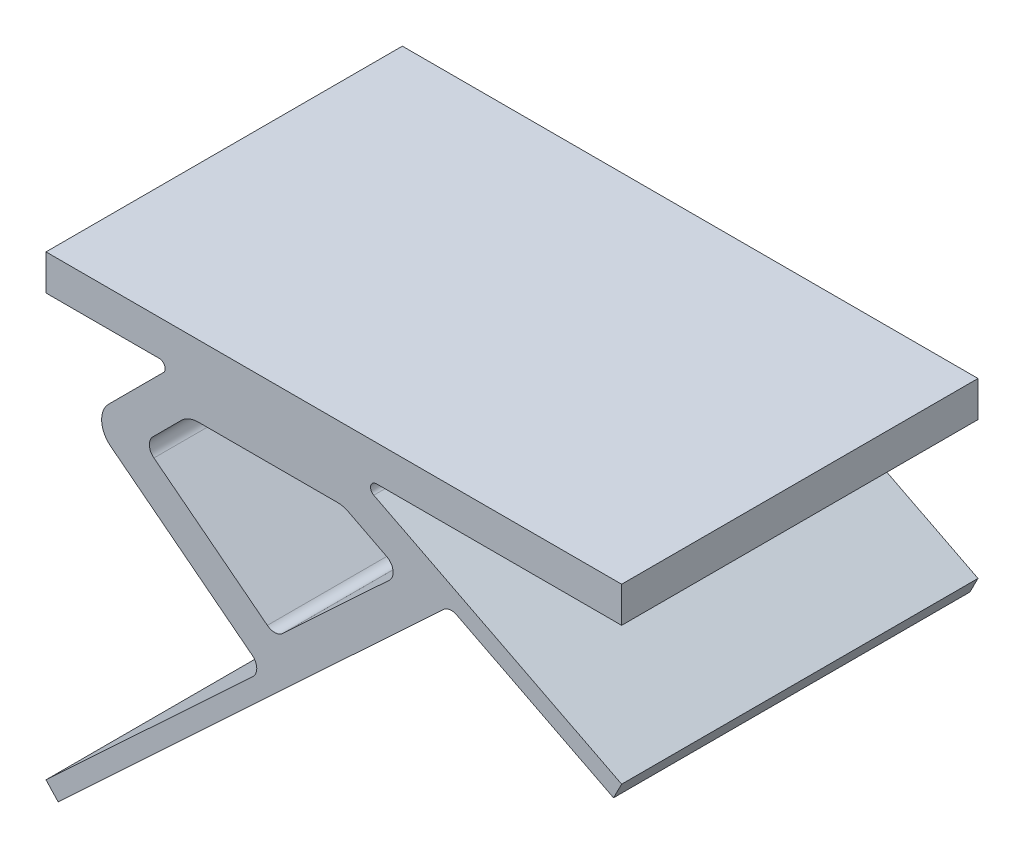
ISO-10303-21;
HEADER;
FILE_DESCRIPTION(('STEP AP214'),'2;1');
FILE_NAME('part.step','',(''),(''),'','','');
FILE_SCHEMA(('AUTOMOTIVE_DESIGN { 1 0 10303 214 1 1 1 1 }'));
ENDSEC;
DATA;
#1=APPLICATION_CONTEXT('core data for automotive mechanical design processes');
#2=APPLICATION_PROTOCOL_DEFINITION('international standard','automotive_design',2000,#1);
#3=PRODUCT_CONTEXT('',#1,'mechanical');
#4=PRODUCT('Part','Part','',(#3));
#5=PRODUCT_RELATED_PRODUCT_CATEGORY('part','',(#4));
#6=PRODUCT_DEFINITION_FORMATION('','',#4);
#7=PRODUCT_DEFINITION_CONTEXT('part definition',#1,'design');
#8=PRODUCT_DEFINITION('design','',#6,#7);
#9=PRODUCT_DEFINITION_SHAPE('','',#8);
#10=(LENGTH_UNIT() NAMED_UNIT(*) SI_UNIT(.MILLI.,.METRE.));
#11=(NAMED_UNIT(*) PLANE_ANGLE_UNIT() SI_UNIT($,.RADIAN.));
#12=(NAMED_UNIT(*) SI_UNIT($,.STERADIAN.) SOLID_ANGLE_UNIT());
#13=UNCERTAINTY_MEASURE_WITH_UNIT(LENGTH_MEASURE(1.E-05),#10,'distance_accuracy_value','');
#14=(GEOMETRIC_REPRESENTATION_CONTEXT(3) GLOBAL_UNCERTAINTY_ASSIGNED_CONTEXT((#13)) GLOBAL_UNIT_ASSIGNED_CONTEXT((#10,
#11,#12)) REPRESENTATION_CONTEXT('',''));
#15=CARTESIAN_POINT('',(0.,0.,0.));
#16=DIRECTION('',(0.,0.,1.));
#17=DIRECTION('',(1.,0.,0.));
#18=AXIS2_PLACEMENT_3D('',#15,#16,#17);
#19=CARTESIAN_POINT('',(-1.20710678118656,-0.5,30.));
#20=DIRECTION('',(0.,0.,1.));
#21=DIRECTION('',(1.,0.,0.));
#22=AXIS2_PLACEMENT_3D('',#19,#20,#21);
#23=CYLINDRICAL_SURFACE('',#22,0.5);
#24=DIRECTION('',(0.,0.,-1.));
#25=VECTOR('',#24,1.);
#26=CARTESIAN_POINT('',(-0.853553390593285,-0.853553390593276,30.));
#27=LINE('',#26,#25);
#28=CARTESIAN_POINT('',(-0.853553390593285,-0.853553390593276,30.));
#29=VERTEX_POINT('',#28);
#30=CARTESIAN_POINT('',(-0.853553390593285,-0.853553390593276,0.));
#31=VERTEX_POINT('',#30);
#32=EDGE_CURVE('E478',#29,#31,#27,.T.);
#33=ORIENTED_EDGE('',*,*,#32,.F.);
#34=CARTESIAN_POINT('',(-1.20710678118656,-0.5,30.));
#35=DIRECTION('',(0.,0.,-1.));
#36=DIRECTION('',(-1.,0.,0.));
#37=AXIS2_PLACEMENT_3D('',#34,#35,#36);
#38=CIRCLE('',#37,0.5);
#39=CARTESIAN_POINT('',(-1.20710678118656,0.,30.));
#40=VERTEX_POINT('',#39);
#41=EDGE_CURVE('E46',#29,#40,#38,.F.);
#42=ORIENTED_EDGE('',*,*,#41,.T.);
#43=DIRECTION('',(0.,0.,-1.));
#44=VECTOR('',#43,1.);
#45=CARTESIAN_POINT('',(-1.20710678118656,0.,30.));
#46=LINE('',#45,#44);
#47=CARTESIAN_POINT('',(-1.20710678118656,0.,0.));
#48=VERTEX_POINT('',#47);
#49=EDGE_CURVE('E482',#48,#40,#46,.F.);
#50=ORIENTED_EDGE('',*,*,#49,.F.);
#51=CARTESIAN_POINT('',(-1.20710678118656,-0.5,0.));
#52=DIRECTION('',(0.,0.,-1.));
#53=DIRECTION('',(-1.,0.,0.));
#54=AXIS2_PLACEMENT_3D('',#51,#52,#53);
#55=CIRCLE('',#54,0.5);
#56=EDGE_CURVE('E11',#48,#31,#55,.T.);
#57=ORIENTED_EDGE('',*,*,#56,.T.);
#58=EDGE_LOOP('',(#33,#42,#50,#57));
#59=FACE_BOUND('',#58,.T.);
#60=ADVANCED_FACE('F38',(#59),#23,.F.);
#61=CARTESIAN_POINT('',(17.0826498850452,-0.5,30.));
#62=DIRECTION('',(0.,0.,-1.));
#63=DIRECTION('',(-1.,0.,0.));
#64=AXIS2_PLACEMENT_3D('',#61,#62,#63);
#65=CYLINDRICAL_SURFACE('',#64,0.5);
#66=DIRECTION('',(0.,0.,1.));
#67=VECTOR('',#66,1.);
#68=CARTESIAN_POINT('',(16.8556546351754,-0.945503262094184,30.));
#69=LINE('',#68,#67);
#70=CARTESIAN_POINT('',(16.8556546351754,-0.945503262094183,0.));
#71=VERTEX_POINT('',#70);
#72=CARTESIAN_POINT('',(16.8556546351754,-0.945503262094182,30.));
#73=VERTEX_POINT('',#72);
#74=EDGE_CURVE('E464',#71,#73,#69,.T.);
#75=ORIENTED_EDGE('',*,*,#74,.F.);
#76=CARTESIAN_POINT('',(17.0826498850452,-0.5,0.));
#77=DIRECTION('',(0.,0.,-1.));
#78=DIRECTION('',(-1.,0.,0.));
#79=AXIS2_PLACEMENT_3D('',#76,#77,#78);
#80=CIRCLE('',#79,0.5);
#81=CARTESIAN_POINT('',(17.0826498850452,0.,0.));
#82=VERTEX_POINT('',#81);
#83=EDGE_CURVE('E472',#71,#82,#80,.T.);
#84=ORIENTED_EDGE('',*,*,#83,.T.);
#85=DIRECTION('',(0.,0.,1.));
#86=VECTOR('',#85,1.);
#87=CARTESIAN_POINT('',(17.0826498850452,0.,30.));
#88=LINE('',#87,#86);
#89=CARTESIAN_POINT('',(17.0826498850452,0.,30.));
#90=VERTEX_POINT('',#89);
#91=EDGE_CURVE('E468',#90,#82,#88,.F.);
#92=ORIENTED_EDGE('',*,*,#91,.F.);
#93=CARTESIAN_POINT('',(17.0826498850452,-0.5,30.));
#94=DIRECTION('',(0.,0.,-1.));
#95=DIRECTION('',(-1.,0.,0.));
#96=AXIS2_PLACEMENT_3D('',#93,#94,#95);
#97=CIRCLE('',#96,0.5);
#98=EDGE_CURVE('E475',#90,#73,#97,.F.);
#99=ORIENTED_EDGE('',*,*,#98,.T.);
#100=EDGE_LOOP('',(#75,#84,#92,#99));
#101=FACE_BOUND('',#100,.T.);
#102=ADVANCED_FACE('F532',(#101),#65,.F.);
#103=CARTESIAN_POINT('',(6.00535955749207,-18.5090162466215,30.));
#104=DIRECTION('',(0.,0.,-1.));
#105=DIRECTION('',(-1.,0.,0.));
#106=AXIS2_PLACEMENT_3D('',#103,#104,#105);
#107=CYLINDRICAL_SURFACE('',#106,1.);
#108=DIRECTION('',(0.,0.,1.));
#109=VECTOR('',#108,1.);
#110=CARTESIAN_POINT('',(6.61931929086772,-17.7196789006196,30.));
#111=LINE('',#110,#109);
#112=CARTESIAN_POINT('',(6.61931929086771,-17.7196789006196,0.));
#113=VERTEX_POINT('',#112);
#114=CARTESIAN_POINT('',(6.61931929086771,-17.7196789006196,30.));
#115=VERTEX_POINT('',#114);
#116=EDGE_CURVE('E452',#113,#115,#111,.T.);
#117=ORIENTED_EDGE('',*,*,#116,.F.);
#118=CARTESIAN_POINT('',(6.00535955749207,-18.5090162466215,0.));
#119=DIRECTION('',(0.,0.,-1.));
#120=DIRECTION('',(-1.,0.,0.));
#121=AXIS2_PLACEMENT_3D('',#118,#119,#120);
#122=CIRCLE('',#121,1.);
#123=CARTESIAN_POINT('',(6.68735791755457,-19.2403699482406,0.));
#124=VERTEX_POINT('',#123);
#125=EDGE_CURVE('E459',#113,#124,#122,.T.);
#126=ORIENTED_EDGE('',*,*,#125,.T.);
#127=DIRECTION('',(0.,0.,1.));
#128=VECTOR('',#127,1.);
#129=CARTESIAN_POINT('',(6.68735791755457,-19.2403699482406,30.));
#130=LINE('',#129,#128);
#131=CARTESIAN_POINT('',(6.68735791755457,-19.2403699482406,30.));
#132=VERTEX_POINT('',#131);
#133=EDGE_CURVE('E456',#132,#124,#130,.F.);
#134=ORIENTED_EDGE('',*,*,#133,.F.);
#135=CARTESIAN_POINT('',(6.00535955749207,-18.5090162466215,30.));
#136=DIRECTION('',(0.,0.,-1.));
#137=DIRECTION('',(-1.,0.,0.));
#138=AXIS2_PLACEMENT_3D('',#135,#136,#137);
#139=CIRCLE('',#138,1.);
#140=EDGE_CURVE('E229',#132,#115,#139,.F.);
#141=ORIENTED_EDGE('',*,*,#140,.T.);
#142=EDGE_LOOP('',(#117,#126,#134,#141));
#143=FACE_BOUND('',#142,.T.);
#144=ADVANCED_FACE('F508',(#143),#107,.F.);
#145=CARTESIAN_POINT('',(23.3917258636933,-7.08161348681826,30.));
#146=DIRECTION('',(0.,0.,1.));
#147=DIRECTION('',(1.,0.,0.));
#148=AXIS2_PLACEMENT_3D('',#145,#146,#147);
#149=CYLINDRICAL_SURFACE('',#148,1.);
#150=DIRECTION('',(0.,0.,-1.));
#151=VECTOR('',#150,1.);
#152=CARTESIAN_POINT('',(23.8457163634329,-6.1906069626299,30.));
#153=LINE('',#152,#151);
#154=CARTESIAN_POINT('',(23.8457163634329,-6.19060696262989,30.));
#155=VERTEX_POINT('',#154);
#156=CARTESIAN_POINT('',(23.8457163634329,-6.19060696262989,0.));
#157=VERTEX_POINT('',#156);
#158=EDGE_CURVE('E438',#155,#157,#153,.T.);
#159=ORIENTED_EDGE('',*,*,#158,.F.);
#160=CARTESIAN_POINT('',(23.3917258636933,-7.08161348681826,30.));
#161=DIRECTION('',(0.,0.,-1.));
#162=DIRECTION('',(-1.,0.,0.));
#163=AXIS2_PLACEMENT_3D('',#160,#161,#162);
#164=CIRCLE('',#163,1.);
#165=CARTESIAN_POINT('',(22.7097275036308,-6.35025978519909,30.));
#166=VERTEX_POINT('',#165);
#167=EDGE_CURVE('E446',#155,#166,#164,.F.);
#168=ORIENTED_EDGE('',*,*,#167,.T.);
#169=DIRECTION('',(0.,0.,-1.));
#170=VECTOR('',#169,1.);
#171=CARTESIAN_POINT('',(22.7097275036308,-6.35025978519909,30.));
#172=LINE('',#171,#170);
#173=CARTESIAN_POINT('',(22.7097275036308,-6.3502597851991,0.));
#174=VERTEX_POINT('',#173);
#175=EDGE_CURVE('E442',#174,#166,#172,.F.);
#176=ORIENTED_EDGE('',*,*,#175,.F.);
#177=CARTESIAN_POINT('',(23.3917258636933,-7.08161348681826,0.));
#178=DIRECTION('',(0.,0.,-1.));
#179=DIRECTION('',(-1.,0.,0.));
#180=AXIS2_PLACEMENT_3D('',#177,#178,#179);
#181=CIRCLE('',#180,1.);
#182=EDGE_CURVE('E449',#174,#157,#181,.T.);
#183=ORIENTED_EDGE('',*,*,#182,.T.);
#184=EDGE_LOOP('',(#159,#168,#176,#183));
#185=FACE_BOUND('',#184,.T.);
#186=ADVANCED_FACE('F517',(#185),#149,.F.);
#187=CARTESIAN_POINT('',(8.50980706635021,-14.1225899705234,30.));
#188=DIRECTION('',(0.,0.,-1.));
#189=DIRECTION('',(-1.,0.,0.));
#190=AXIS2_PLACEMENT_3D('',#187,#188,#189);
#191=CYLINDRICAL_SURFACE('',#190,1.);
#192=DIRECTION('',(0.,0.,1.));
#193=VECTOR('',#192,1.);
#194=CARTESIAN_POINT('',(9.19180542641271,-14.8539436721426,30.));
#195=LINE('',#194,#193);
#196=CARTESIAN_POINT('',(9.19180542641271,-14.8539436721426,0.));
#197=VERTEX_POINT('',#196);
#198=CARTESIAN_POINT('',(9.19180542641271,-14.8539436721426,30.));
#199=VERTEX_POINT('',#198);
#200=EDGE_CURVE('E424',#197,#199,#195,.T.);
#201=ORIENTED_EDGE('',*,*,#200,.F.);
#202=CARTESIAN_POINT('',(8.50980706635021,-14.1225899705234,0.));
#203=DIRECTION('',(0.,0.,-1.));
#204=DIRECTION('',(-1.,0.,0.));
#205=AXIS2_PLACEMENT_3D('',#202,#203,#204);
#206=CIRCLE('',#205,1.);
#207=CARTESIAN_POINT('',(7.89584733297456,-14.9119273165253,0.));
#208=VERTEX_POINT('',#207);
#209=EDGE_CURVE('E432',#197,#208,#206,.T.);
#210=ORIENTED_EDGE('',*,*,#209,.T.);
#211=DIRECTION('',(0.,0.,1.));
#212=VECTOR('',#211,1.);
#213=CARTESIAN_POINT('',(7.89584733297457,-14.9119273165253,30.));
#214=LINE('',#213,#212);
#215=CARTESIAN_POINT('',(7.89584733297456,-14.9119273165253,30.));
#216=VERTEX_POINT('',#215);
#217=EDGE_CURVE('E428',#216,#208,#214,.F.);
#218=ORIENTED_EDGE('',*,*,#217,.F.);
#219=CARTESIAN_POINT('',(8.50980706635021,-14.1225899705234,30.));
#220=DIRECTION('',(0.,0.,-1.));
#221=DIRECTION('',(-1.,0.,0.));
#222=AXIS2_PLACEMENT_3D('',#219,#220,#221);
#223=CIRCLE('',#222,1.);
#224=EDGE_CURVE('E435',#216,#199,#223,.F.);
#225=ORIENTED_EDGE('',*,*,#224,.T.);
#226=EDGE_LOOP('',(#201,#210,#218,#225));
#227=FACE_BOUND('',#226,.T.);
#228=ADVANCED_FACE('F599',(#227),#191,.F.);
#229=CARTESIAN_POINT('',(17.4833436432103,-5.75463173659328,30.));
#230=DIRECTION('',(0.,0.,-1.));
#231=DIRECTION('',(-1.,0.,0.));
#232=AXIS2_PLACEMENT_3D('',#229,#230,#231);
#233=CYLINDRICAL_SURFACE('',#232,1.);
#234=DIRECTION('',(0.,0.,1.));
#235=VECTOR('',#234,1.);
#236=CARTESIAN_POINT('',(17.9373341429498,-4.86362521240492,30.));
#237=LINE('',#236,#235);
#238=CARTESIAN_POINT('',(17.9373341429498,-4.86362521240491,0.));
#239=VERTEX_POINT('',#238);
#240=CARTESIAN_POINT('',(17.9373341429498,-4.86362521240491,30.));
#241=VERTEX_POINT('',#240);
#242=EDGE_CURVE('E409',#239,#241,#237,.T.);
#243=ORIENTED_EDGE('',*,*,#242,.F.);
#244=CARTESIAN_POINT('',(17.4833436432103,-5.75463173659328,0.));
#245=DIRECTION('',(0.,0.,-1.));
#246=DIRECTION('',(-1.,0.,0.));
#247=AXIS2_PLACEMENT_3D('',#244,#245,#246);
#248=CIRCLE('',#247,1.);
#249=CARTESIAN_POINT('',(18.1653420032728,-6.48598543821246,0.));
#250=VERTEX_POINT('',#249);
#251=EDGE_CURVE('E417',#239,#250,#248,.T.);
#252=ORIENTED_EDGE('',*,*,#251,.T.);
#253=DIRECTION('',(0.,0.,1.));
#254=VECTOR('',#253,1.);
#255=CARTESIAN_POINT('',(18.1653420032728,-6.48598543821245,30.));
#256=LINE('',#255,#254);
#257=CARTESIAN_POINT('',(18.1653420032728,-6.48598543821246,30.));
#258=VERTEX_POINT('',#257);
#259=EDGE_CURVE('E413',#258,#250,#256,.F.);
#260=ORIENTED_EDGE('',*,*,#259,.F.);
#261=CARTESIAN_POINT('',(17.4833436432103,-5.75463173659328,30.));
#262=DIRECTION('',(0.,0.,-1.));
#263=DIRECTION('',(-1.,0.,0.));
#264=AXIS2_PLACEMENT_3D('',#261,#262,#263);
#265=CIRCLE('',#264,1.);
#266=EDGE_CURVE('E421',#258,#241,#265,.F.);
#267=ORIENTED_EDGE('',*,*,#266,.T.);
#268=EDGE_LOOP('',(#243,#252,#260,#267));
#269=FACE_BOUND('',#268,.T.);
#270=ADVANCED_FACE('F595',(#269),#233,.F.);
#271=CARTESIAN_POINT('',(-1.03872694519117,-6.69558119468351,30.));
#272=DIRECTION('',(0.,0.,-1.));
#273=DIRECTION('',(-1.,0.,0.));
#274=AXIS2_PLACEMENT_3D('',#271,#272,#273);
#275=CYLINDRICAL_SURFACE('',#274,1.);
#276=DIRECTION('',(0.,0.,1.));
#277=VECTOR('',#276,1.);
#278=CARTESIAN_POINT('',(-1.65268667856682,-7.4849185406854,30.));
#279=LINE('',#278,#277);
#280=CARTESIAN_POINT('',(-1.65268667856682,-7.4849185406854,0.));
#281=VERTEX_POINT('',#280);
#282=CARTESIAN_POINT('',(-1.65268667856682,-7.4849185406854,30.));
#283=VERTEX_POINT('',#282);
#284=EDGE_CURVE('E395',#281,#283,#279,.T.);
#285=ORIENTED_EDGE('',*,*,#284,.F.);
#286=CARTESIAN_POINT('',(-1.03872694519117,-6.69558119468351,0.));
#287=DIRECTION('',(0.,0.,-1.));
#288=DIRECTION('',(-1.,0.,0.));
#289=AXIS2_PLACEMENT_3D('',#286,#287,#288);
#290=CIRCLE('',#289,1.);
#291=CARTESIAN_POINT('',(-1.74583372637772,-5.98847441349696,0.));
#292=VERTEX_POINT('',#291);
#293=EDGE_CURVE('E403',#281,#292,#290,.T.);
#294=ORIENTED_EDGE('',*,*,#293,.T.);
#295=DIRECTION('',(0.,0.,1.));
#296=VECTOR('',#295,1.);
#297=CARTESIAN_POINT('',(-1.74583372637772,-5.98847441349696,30.));
#298=LINE('',#297,#296);
#299=CARTESIAN_POINT('',(-1.74583372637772,-5.98847441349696,30.));
#300=VERTEX_POINT('',#299);
#301=EDGE_CURVE('E399',#300,#292,#298,.F.);
#302=ORIENTED_EDGE('',*,*,#301,.F.);
#303=CARTESIAN_POINT('',(-1.03872694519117,-6.69558119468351,30.));
#304=DIRECTION('',(0.,0.,-1.));
#305=DIRECTION('',(-1.,0.,0.));
#306=AXIS2_PLACEMENT_3D('',#303,#304,#305);
#307=CIRCLE('',#306,1.);
#308=EDGE_CURVE('E406',#300,#283,#307,.F.);
#309=ORIENTED_EDGE('',*,*,#308,.T.);
#310=EDGE_LOOP('',(#285,#294,#302,#309));
#311=FACE_BOUND('',#310,.T.);
#312=ADVANCED_FACE('F591',(#311),#275,.F.);
#313=CARTESIAN_POINT('',(13.7996062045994,-5.,30.));
#314=DIRECTION('',(0.,0.,-1.));
#315=DIRECTION('',(-1.,0.,0.));
#316=AXIS2_PLACEMENT_3D('',#313,#314,#315);
#317=CYLINDRICAL_SURFACE('',#316,2.);
#318=DIRECTION('',(0.,0.,1.));
#319=VECTOR('',#318,1.);
#320=CARTESIAN_POINT('',(13.7996062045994,-3.,30.));
#321=LINE('',#320,#319);
#322=CARTESIAN_POINT('',(13.7996062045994,-3.,0.));
#323=VERTEX_POINT('',#322);
#324=CARTESIAN_POINT('',(13.7996062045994,-3.,30.));
#325=VERTEX_POINT('',#324);
#326=EDGE_CURVE('E380',#323,#325,#321,.T.);
#327=ORIENTED_EDGE('',*,*,#326,.F.);
#328=CARTESIAN_POINT('',(13.7996062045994,-5.,0.));
#329=DIRECTION('',(0.,0.,-1.));
#330=DIRECTION('',(-1.,0.,0.));
#331=AXIS2_PLACEMENT_3D('',#328,#329,#330);
#332=CIRCLE('',#331,2.);
#333=CARTESIAN_POINT('',(14.7075872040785,-3.21798695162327,0.));
#334=VERTEX_POINT('',#333);
#335=EDGE_CURVE('E388',#323,#334,#332,.T.);
#336=ORIENTED_EDGE('',*,*,#335,.T.);
#337=DIRECTION('',(0.,0.,1.));
#338=VECTOR('',#337,1.);
#339=CARTESIAN_POINT('',(14.7075872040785,-3.21798695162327,30.));
#340=LINE('',#339,#338);
#341=CARTESIAN_POINT('',(14.7075872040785,-3.21798695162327,30.));
#342=VERTEX_POINT('',#341);
#343=EDGE_CURVE('E384',#342,#334,#340,.F.);
#344=ORIENTED_EDGE('',*,*,#343,.F.);
#345=CARTESIAN_POINT('',(13.7996062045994,-5.,30.));
#346=DIRECTION('',(0.,0.,-1.));
#347=DIRECTION('',(-1.,0.,0.));
#348=AXIS2_PLACEMENT_3D('',#345,#346,#347);
#349=CIRCLE('',#348,2.);
#350=EDGE_CURVE('E392',#342,#325,#349,.F.);
#351=ORIENTED_EDGE('',*,*,#350,.T.);
#352=EDGE_LOOP('',(#327,#336,#344,#351));
#353=FACE_BOUND('',#352,.T.);
#354=ADVANCED_FACE('F583',(#353),#317,.F.);
#355=CARTESIAN_POINT('',(2.07106781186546,-5.,30.));
#356=DIRECTION('',(0.,0.,-1.));
#357=DIRECTION('',(-1.,0.,0.));
#358=AXIS2_PLACEMENT_3D('',#355,#356,#357);
#359=CYLINDRICAL_SURFACE('',#358,2.);
#360=DIRECTION('',(0.,0.,1.));
#361=VECTOR('',#360,1.);
#362=CARTESIAN_POINT('',(0.656854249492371,-3.5857864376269,30.));
#363=LINE('',#362,#361);
#364=CARTESIAN_POINT('',(0.656854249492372,-3.5857864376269,0.));
#365=VERTEX_POINT('',#364);
#366=CARTESIAN_POINT('',(0.656854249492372,-3.5857864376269,30.));
#367=VERTEX_POINT('',#366);
#368=EDGE_CURVE('E365',#365,#367,#363,.T.);
#369=ORIENTED_EDGE('',*,*,#368,.F.);
#370=CARTESIAN_POINT('',(2.07106781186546,-5.,0.));
#371=DIRECTION('',(0.,0.,-1.));
#372=DIRECTION('',(-1.,0.,0.));
#373=AXIS2_PLACEMENT_3D('',#370,#371,#372);
#374=CIRCLE('',#373,2.);
#375=CARTESIAN_POINT('',(2.07106781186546,-3.,0.));
#376=VERTEX_POINT('',#375);
#377=EDGE_CURVE('E373',#365,#376,#374,.T.);
#378=ORIENTED_EDGE('',*,*,#377,.T.);
#379=DIRECTION('',(0.,0.,1.));
#380=VECTOR('',#379,1.);
#381=CARTESIAN_POINT('',(2.07106781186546,-3.,30.));
#382=LINE('',#381,#380);
#383=CARTESIAN_POINT('',(2.07106781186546,-3.,30.));
#384=VERTEX_POINT('',#383);
#385=EDGE_CURVE('E369',#384,#376,#382,.F.);
#386=ORIENTED_EDGE('',*,*,#385,.F.);
#387=CARTESIAN_POINT('',(2.07106781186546,-5.,30.));
#388=DIRECTION('',(0.,0.,-1.));
#389=DIRECTION('',(-1.,0.,0.));
#390=AXIS2_PLACEMENT_3D('',#387,#388,#389);
#391=CIRCLE('',#390,2.);
#392=EDGE_CURVE('E377',#384,#367,#391,.F.);
#393=ORIENTED_EDGE('',*,*,#392,.T.);
#394=EDGE_LOOP('',(#369,#378,#386,#393));
#395=FACE_BOUND('',#394,.T.);
#396=ADVANCED_FACE('F575',(#395),#359,.F.);
#397=CARTESIAN_POINT('',(-4.05489737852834,-6.88332450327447,30.));
#398=DIRECTION('',(0.,0.,-1.));
#399=DIRECTION('',(-1.,0.,0.));
#400=AXIS2_PLACEMENT_3D('',#397,#398,#399);
#401=CYLINDRICAL_SURFACE('',#400,2.);
#402=DIRECTION('',(0.,0.,-1.));
#403=VECTOR('',#402,1.);
#404=CARTESIAN_POINT('',(-5.28281684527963,-8.46199919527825,30.));
#405=LINE('',#404,#403);
#406=CARTESIAN_POINT('',(-5.28281684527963,-8.46199919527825,30.));
#407=VERTEX_POINT('',#406);
#408=CARTESIAN_POINT('',(-5.28281684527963,-8.46199919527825,0.));
#409=VERTEX_POINT('',#408);
#410=EDGE_CURVE('E245',#407,#409,#405,.T.);
#411=ORIENTED_EDGE('',*,*,#410,.F.);
#412=CARTESIAN_POINT('',(-4.05489737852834,-6.88332450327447,30.));
#413=DIRECTION('',(0.,0.,-1.));
#414=DIRECTION('',(-1.,0.,0.));
#415=AXIS2_PLACEMENT_3D('',#412,#413,#414);
#416=CIRCLE('',#415,2.);
#417=CARTESIAN_POINT('',(-5.46911094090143,-5.46911094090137,30.));
#418=VERTEX_POINT('',#417);
#419=EDGE_CURVE('E358',#418,#407,#416,.F.);
#420=ORIENTED_EDGE('',*,*,#419,.F.);
#421=DIRECTION('',(0.,0.,-1.));
#422=VECTOR('',#421,1.);
#423=CARTESIAN_POINT('',(-5.46911094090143,-5.46911094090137,30.));
#424=LINE('',#423,#422);
#425=CARTESIAN_POINT('',(-5.46911094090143,-5.46911094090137,0.));
#426=VERTEX_POINT('',#425);
#427=EDGE_CURVE('E354',#426,#418,#424,.F.);
#428=ORIENTED_EDGE('',*,*,#427,.F.);
#429=CARTESIAN_POINT('',(-4.05489737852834,-6.88332450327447,0.));
#430=DIRECTION('',(0.,0.,-1.));
#431=DIRECTION('',(-1.,0.,0.));
#432=AXIS2_PLACEMENT_3D('',#429,#430,#431);
#433=CIRCLE('',#432,2.);
#434=EDGE_CURVE('E361',#409,#426,#433,.T.);
#435=ORIENTED_EDGE('',*,*,#434,.F.);
#436=EDGE_LOOP('',(#411,#420,#428,#435));
#437=FACE_BOUND('',#436,.T.);
#438=ADVANCED_FACE('F573',(#437),#401,.T.);
#439=CARTESIAN_POINT('',(0.,0.,30.));
#440=DIRECTION('',(0.,0.,-1.));
#441=DIRECTION('',(-1.,0.,0.));
#442=AXIS2_PLACEMENT_3D('',#439,#440,#441);
#443=PLANE('',#442);
#444=ORIENTED_EDGE('',*,*,#41,.F.);
#445=DIRECTION('',(-0.707106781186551,-0.707106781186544,0.));
#446=VECTOR('',#445,1.);
#447=CARTESIAN_POINT('',(0.,0.,30.));
#448=LINE('',#447,#446);
#449=EDGE_CURVE('E492',#29,#418,#448,.T.);
#450=ORIENTED_EDGE('',*,*,#449,.T.);
#451=ORIENTED_EDGE('',*,*,#419,.T.);
#452=DIRECTION('',(0.789337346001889,-0.613959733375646,0.));
#453=VECTOR('',#452,1.);
#454=CARTESIAN_POINT('',(-7.07106781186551,-7.07106781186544,30.));
#455=LINE('',#454,#453);
#456=EDGE_CURVE('E234',#407,#115,#455,.T.);
#457=ORIENTED_EDGE('',*,*,#456,.T.);
#458=ORIENTED_EDGE('',*,*,#140,.F.);
#459=DIRECTION('',(-0.731353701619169,-0.6819983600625,0.));
#460=VECTOR('',#459,1.);
#461=CARTESIAN_POINT('',(7.54553615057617,-18.440105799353,30.));
#462=LINE('',#461,#460);
#463=CARTESIAN_POINT('',(-10.7383063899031,-35.4900648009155,30.));
#464=VERTEX_POINT('',#463);
#465=EDGE_CURVE('E220',#132,#464,#462,.T.);
#466=ORIENTED_EDGE('',*,*,#465,.T.);
#467=DIRECTION('',(0.6819983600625,-0.731353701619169,0.));
#468=VECTOR('',#467,1.);
#469=CARTESIAN_POINT('',(-10.7383063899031,-35.4900648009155,30.));
#470=LINE('',#469,#468);
#471=CARTESIAN_POINT('',(-9.7153088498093,-36.5870953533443,30.));
#472=VERTEX_POINT('',#471);
#473=EDGE_CURVE('E226',#464,#472,#470,.T.);
#474=ORIENTED_EDGE('',*,*,#473,.T.);
#475=DIRECTION('',(0.731353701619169,0.681998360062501,0.));
#476=VECTOR('',#475,1.);
#477=CARTESIAN_POINT('',(8.56853369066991,-19.5371363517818,30.));
#478=LINE('',#477,#476);
#479=EDGE_CURVE('E252',#472,#166,#478,.T.);
#480=ORIENTED_EDGE('',*,*,#479,.T.);
#481=ORIENTED_EDGE('',*,*,#167,.F.);
#482=DIRECTION('',(0.891006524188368,-0.453990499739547,0.));
#483=VECTOR('',#482,1.);
#484=CARTESIAN_POINT('',(23.2218268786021,-5.87271939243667,30.));
#485=LINE('',#484,#483);
#486=CARTESIAN_POINT('',(37.0396806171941,-12.913267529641,30.));
#487=VERTEX_POINT('',#486);
#488=EDGE_CURVE('E255',#155,#487,#485,.T.);
#489=ORIENTED_EDGE('',*,*,#488,.T.);
#490=DIRECTION('',(0.453990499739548,0.891006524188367,0.));
#491=VECTOR('',#490,1.);
#492=CARTESIAN_POINT('',(37.0396806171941,-12.913267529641,30.));
#493=LINE('',#492,#491);
#494=CARTESIAN_POINT('',(37.7206663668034,-11.5767577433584,30.));
#495=VERTEX_POINT('',#494);
#496=EDGE_CURVE('E261',#487,#495,#493,.T.);
#497=ORIENTED_EDGE('',*,*,#496,.T.);
#498=DIRECTION('',(-0.891006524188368,0.453990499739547,0.));
#499=VECTOR('',#498,1.);
#500=CARTESIAN_POINT('',(23.9100652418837,-4.53990499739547,30.));
#501=LINE('',#500,#499);
#502=EDGE_CURVE('E264',#495,#73,#501,.T.);
#503=ORIENTED_EDGE('',*,*,#502,.T.);
#504=ORIENTED_EDGE('',*,*,#98,.F.);
#505=DIRECTION('',(1.,0.,0.));
#506=VECTOR('',#505,1.);
#507=CARTESIAN_POINT('',(15.,0.,30.));
#508=LINE('',#507,#506);
#509=CARTESIAN_POINT('',(37.7206663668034,0.,30.));
#510=VERTEX_POINT('',#509);
#511=EDGE_CURVE('E268',#90,#510,#508,.T.);
#512=ORIENTED_EDGE('',*,*,#511,.T.);
#513=DIRECTION('',(0.,1.,0.));
#514=VECTOR('',#513,1.);
#515=CARTESIAN_POINT('',(37.7206663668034,3.,30.));
#516=LINE('',#515,#514);
#517=CARTESIAN_POINT('',(37.7206663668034,3.,30.));
#518=VERTEX_POINT('',#517);
#519=EDGE_CURVE('E271',#510,#518,#516,.T.);
#520=ORIENTED_EDGE('',*,*,#519,.T.);
#521=DIRECTION('',(-1.,0.,0.));
#522=VECTOR('',#521,1.);
#523=CARTESIAN_POINT('',(-10.7383063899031,3.,30.));
#524=LINE('',#523,#522);
#525=CARTESIAN_POINT('',(-10.7383063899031,3.,30.));
#526=VERTEX_POINT('',#525);
#527=EDGE_CURVE('E274',#518,#526,#524,.T.);
#528=ORIENTED_EDGE('',*,*,#527,.T.);
#529=DIRECTION('',(0.,-1.,0.));
#530=VECTOR('',#529,1.);
#531=CARTESIAN_POINT('',(-10.7383063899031,0.,30.));
#532=LINE('',#531,#530);
#533=CARTESIAN_POINT('',(-10.7383063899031,0.,30.));
#534=VERTEX_POINT('',#533);
#535=EDGE_CURVE('E277',#526,#534,#532,.T.);
#536=ORIENTED_EDGE('',*,*,#535,.T.);
#537=DIRECTION('',(1.,0.,0.));
#538=VECTOR('',#537,1.);
#539=CARTESIAN_POINT('',(0.,0.,30.));
#540=LINE('',#539,#538);
#541=EDGE_CURVE('E325',#534,#40,#540,.T.);
#542=ORIENTED_EDGE('',*,*,#541,.T.);
#543=EDGE_LOOP('',(#444,#450,#451,#457,#458,#466,#474,#480,#481,#489,#497,#503,#504,#512,#520,
#528,#536,#542));
#544=FACE_BOUND('',#543,.T.);
#545=DIRECTION('',(0.789337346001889,-0.613959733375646,0.));
#546=VECTOR('',#545,1.);
#547=CARTESIAN_POINT('',(-2.54681216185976,-6.78945284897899,30.));
#548=LINE('',#547,#546);
#549=EDGE_CURVE('E767',#283,#216,#548,.T.);
#550=ORIENTED_EDGE('',*,*,#549,.F.);
#551=ORIENTED_EDGE('',*,*,#308,.F.);
#552=DIRECTION('',(-0.707106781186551,-0.707106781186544,0.));
#553=VECTOR('',#552,1.);
#554=CARTESIAN_POINT('',(1.24264068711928,-3.,30.));
#555=LINE('',#554,#553);
#556=EDGE_CURVE('E286',#367,#300,#555,.T.);
#557=ORIENTED_EDGE('',*,*,#556,.F.);
#558=ORIENTED_EDGE('',*,*,#392,.F.);
#559=DIRECTION('',(-1.,0.,0.));
#560=VECTOR('',#559,1.);
#561=CARTESIAN_POINT('',(1.24264068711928,-3.,30.));
#562=LINE('',#561,#560);
#563=EDGE_CURVE('E747',#325,#384,#562,.T.);
#564=ORIENTED_EDGE('',*,*,#563,.F.);
#565=ORIENTED_EDGE('',*,*,#350,.F.);
#566=DIRECTION('',(-0.891006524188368,0.453990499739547,0.));
#567=VECTOR('',#566,1.);
#568=CARTESIAN_POINT('',(14.2797637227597,-3.,30.));
#569=LINE('',#568,#567);
#570=EDGE_CURVE('E750',#241,#342,#569,.T.);
#571=ORIENTED_EDGE('',*,*,#570,.F.);
#572=ORIENTED_EDGE('',*,*,#266,.F.);
#573=DIRECTION('',(0.731353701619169,0.6819983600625,0.));
#574=VECTOR('',#573,1.);
#575=CARTESIAN_POINT('',(8.56853369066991,-15.435153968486,30.));
#576=LINE('',#575,#574);
#577=EDGE_CURVE('E770',#199,#258,#576,.T.);
#578=ORIENTED_EDGE('',*,*,#577,.F.);
#579=ORIENTED_EDGE('',*,*,#224,.F.);
#580=EDGE_LOOP('',(#550,#551,#557,#558,#564,#565,#571,#572,#578,#579));
#581=FACE_BOUND('',#580,.T.);
#582=ADVANCED_FACE('F222',(#544,#581),#443,.F.);
#583=CARTESIAN_POINT('',(0.,0.,0.));
#584=DIRECTION('',(0.,0.,-1.));
#585=DIRECTION('',(-1.,0.,0.));
#586=AXIS2_PLACEMENT_3D('',#583,#584,#585);
#587=PLANE('',#586);
#588=ORIENTED_EDGE('',*,*,#209,.F.);
#589=DIRECTION('',(0.731353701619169,0.6819983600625,0.));
#590=VECTOR('',#589,1.);
#591=CARTESIAN_POINT('',(8.56853369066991,-15.435153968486,0.));
#592=LINE('',#591,#590);
#593=EDGE_CURVE('E758',#197,#250,#592,.T.);
#594=ORIENTED_EDGE('',*,*,#593,.T.);
#595=ORIENTED_EDGE('',*,*,#251,.F.);
#596=DIRECTION('',(-0.891006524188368,0.453990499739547,0.));
#597=VECTOR('',#596,1.);
#598=CARTESIAN_POINT('',(14.2797637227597,-3.,0.));
#599=LINE('',#598,#597);
#600=EDGE_CURVE('E761',#239,#334,#599,.T.);
#601=ORIENTED_EDGE('',*,*,#600,.T.);
#602=ORIENTED_EDGE('',*,*,#335,.F.);
#603=DIRECTION('',(-1.,0.,0.));
#604=VECTOR('',#603,1.);
#605=CARTESIAN_POINT('',(1.24264068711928,-3.,0.));
#606=LINE('',#605,#604);
#607=EDGE_CURVE('E763',#323,#376,#606,.T.);
#608=ORIENTED_EDGE('',*,*,#607,.T.);
#609=ORIENTED_EDGE('',*,*,#377,.F.);
#610=DIRECTION('',(-0.707106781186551,-0.707106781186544,0.));
#611=VECTOR('',#610,1.);
#612=CARTESIAN_POINT('',(1.24264068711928,-3.,0.));
#613=LINE('',#612,#611);
#614=EDGE_CURVE('E497',#365,#292,#613,.T.);
#615=ORIENTED_EDGE('',*,*,#614,.T.);
#616=ORIENTED_EDGE('',*,*,#293,.F.);
#617=DIRECTION('',(0.789337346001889,-0.613959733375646,0.));
#618=VECTOR('',#617,1.);
#619=CARTESIAN_POINT('',(-2.54681216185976,-6.78945284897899,0.));
#620=LINE('',#619,#618);
#621=EDGE_CURVE('E754',#281,#208,#620,.T.);
#622=ORIENTED_EDGE('',*,*,#621,.T.);
#623=EDGE_LOOP('',(#588,#594,#595,#601,#602,#608,#609,#615,#616,#622));
#624=FACE_BOUND('',#623,.T.);
#625=DIRECTION('',(0.789337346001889,-0.613959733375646,0.));
#626=VECTOR('',#625,1.);
#627=CARTESIAN_POINT('',(-7.07106781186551,-7.07106781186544,0.));
#628=LINE('',#627,#626);
#629=EDGE_CURVE('E289',#409,#113,#628,.T.);
#630=ORIENTED_EDGE('',*,*,#629,.F.);
#631=ORIENTED_EDGE('',*,*,#434,.T.);
#632=DIRECTION('',(-0.707106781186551,-0.707106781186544,0.));
#633=VECTOR('',#632,1.);
#634=CARTESIAN_POINT('',(0.,0.,0.));
#635=LINE('',#634,#633);
#636=EDGE_CURVE('E285',#31,#426,#635,.T.);
#637=ORIENTED_EDGE('',*,*,#636,.F.);
#638=ORIENTED_EDGE('',*,*,#56,.F.);
#639=DIRECTION('',(1.,0.,0.));
#640=VECTOR('',#639,1.);
#641=CARTESIAN_POINT('',(0.,0.,0.));
#642=LINE('',#641,#640);
#643=CARTESIAN_POINT('',(-10.7383063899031,0.,0.));
#644=VERTEX_POINT('',#643);
#645=EDGE_CURVE('E281',#644,#48,#642,.T.);
#646=ORIENTED_EDGE('',*,*,#645,.F.);
#647=DIRECTION('',(0.,-1.,0.));
#648=VECTOR('',#647,1.);
#649=CARTESIAN_POINT('',(-10.7383063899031,0.,0.));
#650=LINE('',#649,#648);
#651=CARTESIAN_POINT('',(-10.7383063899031,3.,0.));
#652=VERTEX_POINT('',#651);
#653=EDGE_CURVE('E322',#652,#644,#650,.T.);
#654=ORIENTED_EDGE('',*,*,#653,.F.);
#655=DIRECTION('',(-1.,0.,0.));
#656=VECTOR('',#655,1.);
#657=CARTESIAN_POINT('',(-10.7383063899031,3.,0.));
#658=LINE('',#657,#656);
#659=CARTESIAN_POINT('',(37.7206663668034,3.,0.));
#660=VERTEX_POINT('',#659);
#661=EDGE_CURVE('E319',#660,#652,#658,.T.);
#662=ORIENTED_EDGE('',*,*,#661,.F.);
#663=DIRECTION('',(0.,1.,0.));
#664=VECTOR('',#663,1.);
#665=CARTESIAN_POINT('',(37.7206663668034,3.,0.));
#666=LINE('',#665,#664);
#667=CARTESIAN_POINT('',(37.7206663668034,0.,0.));
#668=VERTEX_POINT('',#667);
#669=EDGE_CURVE('E316',#668,#660,#666,.T.);
#670=ORIENTED_EDGE('',*,*,#669,.F.);
#671=DIRECTION('',(1.,0.,0.));
#672=VECTOR('',#671,1.);
#673=CARTESIAN_POINT('',(15.,0.,0.));
#674=LINE('',#673,#672);
#675=EDGE_CURVE('E313',#82,#668,#674,.T.);
#676=ORIENTED_EDGE('',*,*,#675,.F.);
#677=ORIENTED_EDGE('',*,*,#83,.F.);
#678=DIRECTION('',(-0.891006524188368,0.453990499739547,0.));
#679=VECTOR('',#678,1.);
#680=CARTESIAN_POINT('',(15.,0.,0.));
#681=LINE('',#680,#679);
#682=CARTESIAN_POINT('',(37.7206663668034,-11.5767577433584,0.));
#683=VERTEX_POINT('',#682);
#684=EDGE_CURVE('E309',#683,#71,#681,.T.);
#685=ORIENTED_EDGE('',*,*,#684,.F.);
#686=DIRECTION('',(0.453990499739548,0.891006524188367,0.));
#687=VECTOR('',#686,1.);
#688=CARTESIAN_POINT('',(37.0396806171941,-12.913267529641,0.));
#689=LINE('',#688,#687);
#690=CARTESIAN_POINT('',(37.0396806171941,-12.913267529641,0.));
#691=VERTEX_POINT('',#690);
#692=EDGE_CURVE('E305',#691,#683,#689,.T.);
#693=ORIENTED_EDGE('',*,*,#692,.F.);
#694=DIRECTION('',(0.891006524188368,-0.453990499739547,0.));
#695=VECTOR('',#694,1.);
#696=CARTESIAN_POINT('',(23.2218268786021,-5.87271939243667,0.));
#697=LINE('',#696,#695);
#698=EDGE_CURVE('E302',#157,#691,#697,.T.);
#699=ORIENTED_EDGE('',*,*,#698,.F.);
#700=ORIENTED_EDGE('',*,*,#182,.F.);
#701=DIRECTION('',(0.731353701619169,0.6819983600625,0.));
#702=VECTOR('',#701,1.);
#703=CARTESIAN_POINT('',(8.56853369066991,-19.5371363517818,0.));
#704=LINE('',#703,#702);
#705=CARTESIAN_POINT('',(-9.7153088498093,-36.5870953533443,0.));
#706=VERTEX_POINT('',#705);
#707=EDGE_CURVE('E298',#706,#174,#704,.T.);
#708=ORIENTED_EDGE('',*,*,#707,.F.);
#709=DIRECTION('',(0.6819983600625,-0.731353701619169,0.));
#710=VECTOR('',#709,1.);
#711=CARTESIAN_POINT('',(-10.7383063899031,-35.4900648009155,0.));
#712=LINE('',#711,#710);
#713=CARTESIAN_POINT('',(-10.7383063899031,-35.4900648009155,0.));
#714=VERTEX_POINT('',#713);
#715=EDGE_CURVE('E295',#714,#706,#712,.T.);
#716=ORIENTED_EDGE('',*,*,#715,.F.);
#717=DIRECTION('',(-0.731353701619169,-0.6819983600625,0.));
#718=VECTOR('',#717,1.);
#719=CARTESIAN_POINT('',(7.54553615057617,-18.440105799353,0.));
#720=LINE('',#719,#718);
#721=EDGE_CURVE('E240',#124,#714,#720,.T.);
#722=ORIENTED_EDGE('',*,*,#721,.F.);
#723=ORIENTED_EDGE('',*,*,#125,.F.);
#724=EDGE_LOOP('',(#630,#631,#637,#638,#646,#654,#662,#670,#676,#677,#685,#693,#699,#700,#708,
#716,#722,#723));
#725=FACE_BOUND('',#724,.T.);
#726=ADVANCED_FACE('F509',(#624,#725),#587,.T.);
#727=CARTESIAN_POINT('',(0.,0.,30.));
#728=DIRECTION('',(0.,1.,0.));
#729=DIRECTION('',(-1.,0.,0.));
#730=AXIS2_PLACEMENT_3D('',#727,#728,#729);
#731=PLANE('',#730);
#732=ORIENTED_EDGE('',*,*,#645,.T.);
#733=ORIENTED_EDGE('',*,*,#49,.T.);
#734=ORIENTED_EDGE('',*,*,#541,.F.);
#735=DIRECTION('',(0.,0.,-1.));
#736=VECTOR('',#735,1.);
#737=CARTESIAN_POINT('',(-10.7383063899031,0.,30.));
#738=LINE('',#737,#736);
#739=EDGE_CURVE('E280',#534,#644,#738,.T.);
#740=ORIENTED_EDGE('',*,*,#739,.T.);
#741=EDGE_LOOP('',(#732,#733,#734,#740));
#742=FACE_BOUND('',#741,.T.);
#743=ADVANCED_FACE('F488',(#742),#731,.F.);
#744=CARTESIAN_POINT('',(0.,0.,30.));
#745=DIRECTION('',(0.707106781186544,-0.707106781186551,0.));
#746=DIRECTION('',(0.707106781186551,0.707106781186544,0.));
#747=AXIS2_PLACEMENT_3D('',#744,#745,#746);
#748=PLANE('',#747);
#749=ORIENTED_EDGE('',*,*,#449,.F.);
#750=ORIENTED_EDGE('',*,*,#32,.T.);
#751=ORIENTED_EDGE('',*,*,#636,.T.);
#752=ORIENTED_EDGE('',*,*,#427,.T.);
#753=EDGE_LOOP('',(#749,#750,#751,#752));
#754=FACE_BOUND('',#753,.T.);
#755=ADVANCED_FACE('F570',(#754),#748,.F.);
#756=CARTESIAN_POINT('',(-7.07106781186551,-7.07106781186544,30.));
#757=DIRECTION('',(0.613959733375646,0.789337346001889,0.));
#758=DIRECTION('',(-0.789337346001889,0.613959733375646,0.));
#759=AXIS2_PLACEMENT_3D('',#756,#757,#758);
#760=PLANE('',#759);
#761=ORIENTED_EDGE('',*,*,#629,.T.);
#762=ORIENTED_EDGE('',*,*,#116,.T.);
#763=ORIENTED_EDGE('',*,*,#456,.F.);
#764=ORIENTED_EDGE('',*,*,#410,.T.);
#765=EDGE_LOOP('',(#761,#762,#763,#764));
#766=FACE_BOUND('',#765,.T.);
#767=ADVANCED_FACE('F504',(#766),#760,.F.);
#768=CARTESIAN_POINT('',(7.54553615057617,-18.440105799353,30.));
#769=DIRECTION('',(0.6819983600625,-0.731353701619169,0.));
#770=DIRECTION('',(0.731353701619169,0.681998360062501,0.));
#771=AXIS2_PLACEMENT_3D('',#768,#769,#770);
#772=PLANE('',#771);
#773=ORIENTED_EDGE('',*,*,#465,.F.);
#774=ORIENTED_EDGE('',*,*,#133,.T.);
#775=ORIENTED_EDGE('',*,*,#721,.T.);
#776=DIRECTION('',(0.,0.,-1.));
#777=VECTOR('',#776,1.);
#778=CARTESIAN_POINT('',(-10.7383063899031,-35.4900648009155,30.));
#779=LINE('',#778,#777);
#780=EDGE_CURVE('E237',#464,#714,#779,.T.);
#781=ORIENTED_EDGE('',*,*,#780,.F.);
#782=EDGE_LOOP('',(#773,#774,#775,#781));
#783=FACE_BOUND('',#782,.T.);
#784=ADVANCED_FACE('F238',(#783),#772,.F.);
#785=CARTESIAN_POINT('',(-10.7383063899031,-35.4900648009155,30.));
#786=DIRECTION('',(0.731353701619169,0.6819983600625,0.));
#787=DIRECTION('',(-0.6819983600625,0.731353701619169,0.));
#788=AXIS2_PLACEMENT_3D('',#785,#786,#787);
#789=PLANE('',#788);
#790=ORIENTED_EDGE('',*,*,#715,.T.);
#791=DIRECTION('',(0.,0.,-1.));
#792=VECTOR('',#791,1.);
#793=CARTESIAN_POINT('',(-9.7153088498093,-36.5870953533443,30.));
#794=LINE('',#793,#792);
#795=EDGE_CURVE('E246',#472,#706,#794,.T.);
#796=ORIENTED_EDGE('',*,*,#795,.F.);
#797=ORIENTED_EDGE('',*,*,#473,.F.);
#798=ORIENTED_EDGE('',*,*,#780,.T.);
#799=EDGE_LOOP('',(#790,#796,#797,#798));
#800=FACE_BOUND('',#799,.T.);
#801=ADVANCED_FACE('F248',(#800),#789,.F.);
#802=CARTESIAN_POINT('',(8.56853369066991,-19.5371363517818,30.));
#803=DIRECTION('',(-0.6819983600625,0.731353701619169,0.));
#804=DIRECTION('',(-0.731353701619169,-0.6819983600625,0.));
#805=AXIS2_PLACEMENT_3D('',#802,#803,#804);
#806=PLANE('',#805);
#807=ORIENTED_EDGE('',*,*,#707,.T.);
#808=ORIENTED_EDGE('',*,*,#175,.T.);
#809=ORIENTED_EDGE('',*,*,#479,.F.);
#810=ORIENTED_EDGE('',*,*,#795,.T.);
#811=EDGE_LOOP('',(#807,#808,#809,#810));
#812=FACE_BOUND('',#811,.T.);
#813=ADVANCED_FACE('F511',(#812),#806,.F.);
#814=CARTESIAN_POINT('',(23.2218268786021,-5.87271939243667,30.));
#815=DIRECTION('',(0.453990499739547,0.891006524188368,0.));
#816=DIRECTION('',(-0.891006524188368,0.453990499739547,0.));
#817=AXIS2_PLACEMENT_3D('',#814,#815,#816);
#818=PLANE('',#817);
#819=ORIENTED_EDGE('',*,*,#488,.F.);
#820=ORIENTED_EDGE('',*,*,#158,.T.);
#821=ORIENTED_EDGE('',*,*,#698,.T.);
#822=DIRECTION('',(0.,0.,-1.));
#823=VECTOR('',#822,1.);
#824=CARTESIAN_POINT('',(37.0396806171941,-12.913267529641,30.));
#825=LINE('',#824,#823);
#826=EDGE_CURVE('E345',#487,#691,#825,.T.);
#827=ORIENTED_EDGE('',*,*,#826,.F.);
#828=EDGE_LOOP('',(#819,#820,#821,#827));
#829=FACE_BOUND('',#828,.T.);
#830=ADVANCED_FACE('F520',(#829),#818,.F.);
#831=CARTESIAN_POINT('',(37.0396806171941,-12.913267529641,30.));
#832=DIRECTION('',(-0.891006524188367,0.453990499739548,0.));
#833=DIRECTION('',(-0.453990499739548,-0.891006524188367,0.));
#834=AXIS2_PLACEMENT_3D('',#831,#832,#833);
#835=PLANE('',#834);
#836=ORIENTED_EDGE('',*,*,#692,.T.);
#837=DIRECTION('',(0.,0.,-1.));
#838=VECTOR('',#837,1.);
#839=CARTESIAN_POINT('',(37.7206663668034,-11.5767577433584,30.));
#840=LINE('',#839,#838);
#841=EDGE_CURVE('E341',#495,#683,#840,.T.);
#842=ORIENTED_EDGE('',*,*,#841,.F.);
#843=ORIENTED_EDGE('',*,*,#496,.F.);
#844=ORIENTED_EDGE('',*,*,#826,.T.);
#845=EDGE_LOOP('',(#836,#842,#843,#844));
#846=FACE_BOUND('',#845,.T.);
#847=ADVANCED_FACE('F525',(#846),#835,.F.);
#848=CARTESIAN_POINT('',(15.,0.,30.));
#849=DIRECTION('',(-0.453990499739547,-0.891006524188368,0.));
#850=DIRECTION('',(0.891006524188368,-0.453990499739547,0.));
#851=AXIS2_PLACEMENT_3D('',#848,#849,#850);
#852=PLANE('',#851);
#853=ORIENTED_EDGE('',*,*,#684,.T.);
#854=ORIENTED_EDGE('',*,*,#74,.T.);
#855=ORIENTED_EDGE('',*,*,#502,.F.);
#856=ORIENTED_EDGE('',*,*,#841,.T.);
#857=EDGE_LOOP('',(#853,#854,#855,#856));
#858=FACE_BOUND('',#857,.T.);
#859=ADVANCED_FACE('F529',(#858),#852,.F.);
#860=CARTESIAN_POINT('',(15.,0.,30.));
#861=DIRECTION('',(0.,1.,0.));
#862=DIRECTION('',(0.,0.,1.));
#863=AXIS2_PLACEMENT_3D('',#860,#861,#862);
#864=PLANE('',#863);
#865=ORIENTED_EDGE('',*,*,#511,.F.);
#866=ORIENTED_EDGE('',*,*,#91,.T.);
#867=ORIENTED_EDGE('',*,*,#675,.T.);
#868=DIRECTION('',(0.,0.,-1.));
#869=VECTOR('',#868,1.);
#870=CARTESIAN_POINT('',(37.7206663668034,0.,30.));
#871=LINE('',#870,#869);
#872=EDGE_CURVE('E337',#510,#668,#871,.T.);
#873=ORIENTED_EDGE('',*,*,#872,.F.);
#874=EDGE_LOOP('',(#865,#866,#867,#873));
#875=FACE_BOUND('',#874,.T.);
#876=ADVANCED_FACE('F537',(#875),#864,.F.);
#877=CARTESIAN_POINT('',(37.7206663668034,3.,30.));
#878=DIRECTION('',(-1.,0.,0.));
#879=DIRECTION('',(0.,0.,1.));
#880=AXIS2_PLACEMENT_3D('',#877,#878,#879);
#881=PLANE('',#880);
#882=ORIENTED_EDGE('',*,*,#669,.T.);
#883=DIRECTION('',(0.,0.,-1.));
#884=VECTOR('',#883,1.);
#885=CARTESIAN_POINT('',(37.7206663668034,3.,30.));
#886=LINE('',#885,#884);
#887=EDGE_CURVE('E333',#518,#660,#886,.T.);
#888=ORIENTED_EDGE('',*,*,#887,.F.);
#889=ORIENTED_EDGE('',*,*,#519,.F.);
#890=ORIENTED_EDGE('',*,*,#872,.T.);
#891=EDGE_LOOP('',(#882,#888,#889,#890));
#892=FACE_BOUND('',#891,.T.);
#893=ADVANCED_FACE('F543',(#892),#881,.F.);
#894=CARTESIAN_POINT('',(-10.7383063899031,3.,30.));
#895=DIRECTION('',(0.,-1.,0.));
#896=DIRECTION('',(0.,0.,-1.));
#897=AXIS2_PLACEMENT_3D('',#894,#895,#896);
#898=PLANE('',#897);
#899=ORIENTED_EDGE('',*,*,#661,.T.);
#900=DIRECTION('',(0.,0.,-1.));
#901=VECTOR('',#900,1.);
#902=CARTESIAN_POINT('',(-10.7383063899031,3.,30.));
#903=LINE('',#902,#901);
#904=EDGE_CURVE('E329',#526,#652,#903,.T.);
#905=ORIENTED_EDGE('',*,*,#904,.F.);
#906=ORIENTED_EDGE('',*,*,#527,.F.);
#907=ORIENTED_EDGE('',*,*,#887,.T.);
#908=EDGE_LOOP('',(#899,#905,#906,#907));
#909=FACE_BOUND('',#908,.T.);
#910=ADVANCED_FACE('F547',(#909),#898,.F.);
#911=CARTESIAN_POINT('',(-10.7383063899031,0.,30.));
#912=DIRECTION('',(1.,0.,0.));
#913=DIRECTION('',(0.,1.,0.));
#914=AXIS2_PLACEMENT_3D('',#911,#912,#913);
#915=PLANE('',#914);
#916=ORIENTED_EDGE('',*,*,#653,.T.);
#917=ORIENTED_EDGE('',*,*,#739,.F.);
#918=ORIENTED_EDGE('',*,*,#535,.F.);
#919=ORIENTED_EDGE('',*,*,#904,.T.);
#920=EDGE_LOOP('',(#916,#917,#918,#919));
#921=FACE_BOUND('',#920,.T.);
#922=ADVANCED_FACE('F550',(#921),#915,.F.);
#923=CARTESIAN_POINT('',(-2.54681216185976,-6.78945284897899,30.));
#924=DIRECTION('',(0.613959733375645,0.789337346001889,0.));
#925=DIRECTION('',(-0.789337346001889,0.613959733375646,0.));
#926=AXIS2_PLACEMENT_3D('',#923,#924,#925);
#927=PLANE('',#926);
#928=ORIENTED_EDGE('',*,*,#549,.T.);
#929=ORIENTED_EDGE('',*,*,#217,.T.);
#930=ORIENTED_EDGE('',*,*,#621,.F.);
#931=ORIENTED_EDGE('',*,*,#284,.T.);
#932=EDGE_LOOP('',(#928,#929,#930,#931));
#933=FACE_BOUND('',#932,.T.);
#934=ADVANCED_FACE('F552',(#933),#927,.T.);
#935=CARTESIAN_POINT('',(8.56853369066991,-15.435153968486,30.));
#936=DIRECTION('',(-0.6819983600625,0.731353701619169,0.));
#937=DIRECTION('',(-0.731353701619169,-0.681998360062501,0.));
#938=AXIS2_PLACEMENT_3D('',#935,#936,#937);
#939=PLANE('',#938);
#940=ORIENTED_EDGE('',*,*,#593,.F.);
#941=ORIENTED_EDGE('',*,*,#200,.T.);
#942=ORIENTED_EDGE('',*,*,#577,.T.);
#943=ORIENTED_EDGE('',*,*,#259,.T.);
#944=EDGE_LOOP('',(#940,#941,#942,#943));
#945=FACE_BOUND('',#944,.T.);
#946=ADVANCED_FACE('F558',(#945),#939,.T.);
#947=CARTESIAN_POINT('',(14.2797637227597,-3.,30.));
#948=DIRECTION('',(-0.453990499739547,-0.891006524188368,0.));
#949=DIRECTION('',(0.891006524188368,-0.453990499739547,0.));
#950=AXIS2_PLACEMENT_3D('',#947,#948,#949);
#951=PLANE('',#950);
#952=ORIENTED_EDGE('',*,*,#600,.F.);
#953=ORIENTED_EDGE('',*,*,#242,.T.);
#954=ORIENTED_EDGE('',*,*,#570,.T.);
#955=ORIENTED_EDGE('',*,*,#343,.T.);
#956=EDGE_LOOP('',(#952,#953,#954,#955));
#957=FACE_BOUND('',#956,.T.);
#958=ADVANCED_FACE('F727',(#957),#951,.T.);
#959=CARTESIAN_POINT('',(1.24264068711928,-3.,30.));
#960=DIRECTION('',(0.,-1.,0.));
#961=DIRECTION('',(1.,0.,0.));
#962=AXIS2_PLACEMENT_3D('',#959,#960,#961);
#963=PLANE('',#962);
#964=ORIENTED_EDGE('',*,*,#607,.F.);
#965=ORIENTED_EDGE('',*,*,#326,.T.);
#966=ORIENTED_EDGE('',*,*,#563,.T.);
#967=ORIENTED_EDGE('',*,*,#385,.T.);
#968=EDGE_LOOP('',(#964,#965,#966,#967));
#969=FACE_BOUND('',#968,.T.);
#970=ADVANCED_FACE('F731',(#969),#963,.T.);
#971=CARTESIAN_POINT('',(1.24264068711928,-3.,30.));
#972=DIRECTION('',(0.707106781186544,-0.707106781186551,0.));
#973=DIRECTION('',(0.707106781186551,0.707106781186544,0.));
#974=AXIS2_PLACEMENT_3D('',#971,#972,#973);
#975=PLANE('',#974);
#976=ORIENTED_EDGE('',*,*,#556,.T.);
#977=ORIENTED_EDGE('',*,*,#301,.T.);
#978=ORIENTED_EDGE('',*,*,#614,.F.);
#979=ORIENTED_EDGE('',*,*,#368,.T.);
#980=EDGE_LOOP('',(#976,#977,#978,#979));
#981=FACE_BOUND('',#980,.T.);
#982=ADVANCED_FACE('F735',(#981),#975,.T.);
#983=CLOSED_SHELL('',(#60,#102,#144,#186,#228,#270,#312,#354,#396,#438,#582,#726,#743,#755,#767,
#784,#801,#813,#830,#847,#859,#876,#893,#910,#922,#934,#946,#958,#970,#982));
#984=MANIFOLD_SOLID_BREP('B2',#983);
#985=ADVANCED_BREP_SHAPE_REPRESENTATION('',(#18,#984),#14);
#986=SHAPE_DEFINITION_REPRESENTATION(#9,#985);
ENDSEC;
END-ISO-10303-21;
